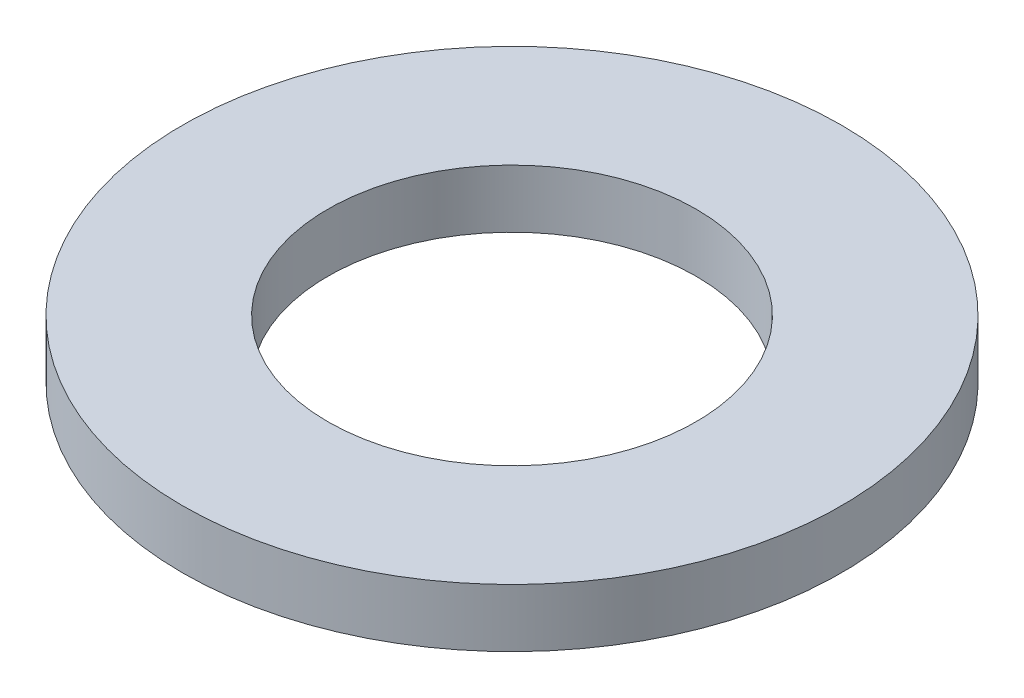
from build123d import *

# Parameters (mm, degrees)
SKETCH1_R      = 17
SKETCH1_R_2    = 9.5
EXTRUDE1_DEPTH = 3


with BuildPart() as part:
    # Sketch1 → Extrude1 (new body)
    with BuildSketch(Plane(origin=(0, 0, 0), x_dir=(1, 0, 0), z_dir=(0, 1, 0))):
        with Locations(Location((0, 0, 0), (0, 0, 270))):
            Circle(SKETCH1_R)
        with Locations(Location((0, 0, 0), (0, 0, 270))):
            Circle(SKETCH1_R_2, mode=Mode.SUBTRACT)
    extrude(amount=EXTRUDE1_DEPTH)


solid = part.part
